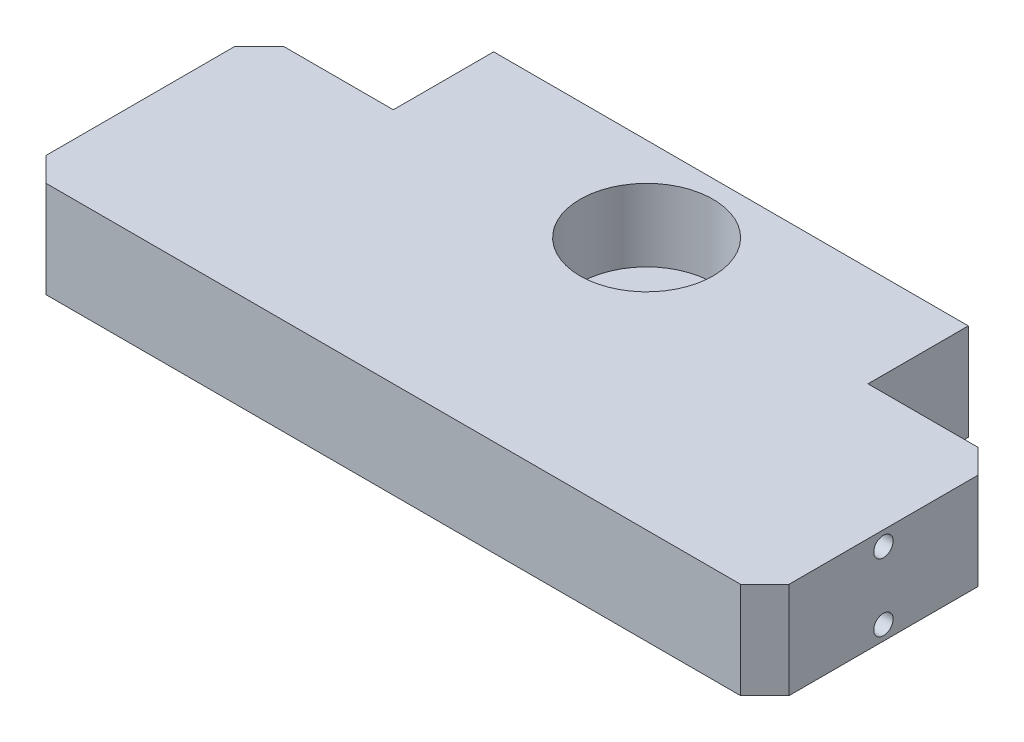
ISO-10303-21;
HEADER;
FILE_DESCRIPTION(('STEP AP214'),'2;1');
FILE_NAME('part.step','',(''),(''),'','','');
FILE_SCHEMA(('AUTOMOTIVE_DESIGN { 1 0 10303 214 1 1 1 1 }'));
ENDSEC;
DATA;
#1=APPLICATION_CONTEXT('core data for automotive mechanical design processes');
#2=APPLICATION_PROTOCOL_DEFINITION('international standard','automotive_design',2000,#1);
#3=PRODUCT_CONTEXT('',#1,'mechanical');
#4=PRODUCT('Part','Part','',(#3));
#5=PRODUCT_RELATED_PRODUCT_CATEGORY('part','',(#4));
#6=PRODUCT_DEFINITION_FORMATION('','',#4);
#7=PRODUCT_DEFINITION_CONTEXT('part definition',#1,'design');
#8=PRODUCT_DEFINITION('design','',#6,#7);
#9=PRODUCT_DEFINITION_SHAPE('','',#8);
#10=(LENGTH_UNIT() NAMED_UNIT(*) SI_UNIT(.MILLI.,.METRE.));
#11=(NAMED_UNIT(*) PLANE_ANGLE_UNIT() SI_UNIT($,.RADIAN.));
#12=(NAMED_UNIT(*) SI_UNIT($,.STERADIAN.) SOLID_ANGLE_UNIT());
#13=UNCERTAINTY_MEASURE_WITH_UNIT(LENGTH_MEASURE(1.E-05),#10,'distance_accuracy_value','');
#14=(GEOMETRIC_REPRESENTATION_CONTEXT(3) GLOBAL_UNCERTAINTY_ASSIGNED_CONTEXT((#13)) GLOBAL_UNIT_ASSIGNED_CONTEXT((#10,
#11,#12)) REPRESENTATION_CONTEXT('',''));
#15=CARTESIAN_POINT('',(0.,0.,0.));
#16=DIRECTION('',(0.,0.,1.));
#17=DIRECTION('',(1.,0.,0.));
#18=AXIS2_PLACEMENT_3D('',#15,#16,#17);
#19=CARTESIAN_POINT('',(0.,25.4,0.));
#20=DIRECTION('',(1.,0.,0.));
#21=DIRECTION('',(0.,0.,-1.));
#22=AXIS2_PLACEMENT_3D('',#19,#20,#21);
#23=PLANE('',#22);
#24=CARTESIAN_POINT('',(0.,21.59,-31.242));
#25=DIRECTION('',(-1.,0.,0.));
#26=DIRECTION('',(0.,0.,1.));
#27=AXIS2_PLACEMENT_3D('',#24,#25,#26);
#28=CIRCLE('',#27,2.55269999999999);
#29=CARTESIAN_POINT('',(0.,21.59,-28.6893));
#30=VERTEX_POINT('',#29);
#31=EDGE_CURVE('E148',#30,#30,#28,.T.);
#32=ORIENTED_EDGE('',*,*,#31,.F.);
#33=EDGE_LOOP('',(#32));
#34=FACE_BOUND('',#33,.T.);
#35=CARTESIAN_POINT('',(0.,3.81,-31.242));
#36=DIRECTION('',(-1.,0.,0.));
#37=DIRECTION('',(0.,0.,1.));
#38=AXIS2_PLACEMENT_3D('',#35,#36,#37);
#39=CIRCLE('',#38,2.55269999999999);
#40=CARTESIAN_POINT('',(0.,3.81,-28.6893));
#41=VERTEX_POINT('',#40);
#42=EDGE_CURVE('E156',#41,#41,#39,.T.);
#43=ORIENTED_EDGE('',*,*,#42,.F.);
#44=EDGE_LOOP('',(#43));
#45=FACE_BOUND('',#44,.T.);
#46=DIRECTION('',(0.,0.,1.));
#47=VECTOR('',#46,1.);
#48=CARTESIAN_POINT('',(0.,0.,0.));
#49=LINE('',#48,#47);
#50=CARTESIAN_POINT('',(0.,0.,-56.134));
#51=VERTEX_POINT('',#50);
#52=CARTESIAN_POINT('',(0.,0.,-6.35000000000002));
#53=VERTEX_POINT('',#52);
#54=EDGE_CURVE('E213',#51,#53,#49,.T.);
#55=ORIENTED_EDGE('',*,*,#54,.T.);
#56=DIRECTION('',(0.,1.,0.));
#57=VECTOR('',#56,1.);
#58=CARTESIAN_POINT('',(0.,25.4,-6.35000000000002));
#59=LINE('',#58,#57);
#60=CARTESIAN_POINT('',(0.,25.4,-6.35000000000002));
#61=VERTEX_POINT('',#60);
#62=EDGE_CURVE('E250',#53,#61,#59,.T.);
#63=ORIENTED_EDGE('',*,*,#62,.T.);
#64=DIRECTION('',(0.,0.,1.));
#65=VECTOR('',#64,1.);
#66=CARTESIAN_POINT('',(0.,25.4,0.));
#67=LINE('',#66,#65);
#68=CARTESIAN_POINT('',(0.,25.4,-56.134));
#69=VERTEX_POINT('',#68);
#70=EDGE_CURVE('E223',#69,#61,#67,.T.);
#71=ORIENTED_EDGE('',*,*,#70,.F.);
#72=DIRECTION('',(0.,-1.,0.));
#73=VECTOR('',#72,1.);
#74=CARTESIAN_POINT('',(0.,25.4,-56.134));
#75=LINE('',#74,#73);
#76=EDGE_CURVE('E247',#69,#51,#75,.T.);
#77=ORIENTED_EDGE('',*,*,#76,.T.);
#78=EDGE_LOOP('',(#55,#63,#71,#77));
#79=FACE_BOUND('',#78,.T.);
#80=ADVANCED_FACE('F38',(#34,#45,#79),#23,.F.);
#81=CARTESIAN_POINT('',(0.,25.4,0.));
#82=DIRECTION('',(0.,0.,-1.));
#83=DIRECTION('',(-1.,0.,0.));
#84=AXIS2_PLACEMENT_3D('',#81,#82,#83);
#85=PLANE('',#84);
#86=DIRECTION('',(1.,0.,0.));
#87=VECTOR('',#86,1.);
#88=CARTESIAN_POINT('',(0.,25.4,0.));
#89=LINE('',#88,#87);
#90=CARTESIAN_POINT('',(6.34999999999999,25.4,0.));
#91=VERTEX_POINT('',#90);
#92=CARTESIAN_POINT('',(189.23,25.4,0.));
#93=VERTEX_POINT('',#92);
#94=EDGE_CURVE('E226',#91,#93,#89,.T.);
#95=ORIENTED_EDGE('',*,*,#94,.F.);
#96=DIRECTION('',(0.,-1.,0.));
#97=VECTOR('',#96,1.);
#98=CARTESIAN_POINT('',(6.34999999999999,25.4,0.));
#99=LINE('',#98,#97);
#100=CARTESIAN_POINT('',(6.35,0.,0.));
#101=VERTEX_POINT('',#100);
#102=EDGE_CURVE('E236',#91,#101,#99,.T.);
#103=ORIENTED_EDGE('',*,*,#102,.T.);
#104=DIRECTION('',(1.,0.,0.));
#105=VECTOR('',#104,1.);
#106=CARTESIAN_POINT('',(0.,0.,0.));
#107=LINE('',#106,#105);
#108=CARTESIAN_POINT('',(189.23,0.,0.));
#109=VERTEX_POINT('',#108);
#110=EDGE_CURVE('E216',#101,#109,#107,.T.);
#111=ORIENTED_EDGE('',*,*,#110,.T.);
#112=DIRECTION('',(0.,1.,0.));
#113=VECTOR('',#112,1.);
#114=CARTESIAN_POINT('',(189.23,25.4,0.));
#115=LINE('',#114,#113);
#116=EDGE_CURVE('E232',#109,#93,#115,.T.);
#117=ORIENTED_EDGE('',*,*,#116,.T.);
#118=EDGE_LOOP('',(#95,#103,#111,#117));
#119=FACE_BOUND('',#118,.T.);
#120=ADVANCED_FACE('F310',(#119),#85,.F.);
#121=CARTESIAN_POINT('',(195.58,25.4,0.));
#122=DIRECTION('',(-1.,0.,0.));
#123=DIRECTION('',(0.,0.,1.));
#124=AXIS2_PLACEMENT_3D('',#121,#122,#123);
#125=PLANE('',#124);
#126=CARTESIAN_POINT('',(195.58,3.81,-31.242));
#127=DIRECTION('',(1.,0.,0.));
#128=DIRECTION('',(0.,0.,-1.));
#129=AXIS2_PLACEMENT_3D('',#126,#127,#128);
#130=CIRCLE('',#129,2.5527);
#131=CARTESIAN_POINT('',(195.58,3.81,-33.7947));
#132=VERTEX_POINT('',#131);
#133=EDGE_CURVE('E162',#132,#132,#130,.T.);
#134=ORIENTED_EDGE('',*,*,#133,.F.);
#135=EDGE_LOOP('',(#134));
#136=FACE_BOUND('',#135,.T.);
#137=CARTESIAN_POINT('',(195.58,21.59,-31.242));
#138=DIRECTION('',(1.,0.,0.));
#139=DIRECTION('',(0.,0.,-1.));
#140=AXIS2_PLACEMENT_3D('',#137,#138,#139);
#141=CIRCLE('',#140,2.5527);
#142=CARTESIAN_POINT('',(195.58,21.59,-33.7947));
#143=VERTEX_POINT('',#142);
#144=EDGE_CURVE('E168',#143,#143,#141,.T.);
#145=ORIENTED_EDGE('',*,*,#144,.F.);
#146=EDGE_LOOP('',(#145));
#147=FACE_BOUND('',#146,.T.);
#148=DIRECTION('',(0.,0.,-1.));
#149=VECTOR('',#148,1.);
#150=CARTESIAN_POINT('',(195.58,25.4,0.));
#151=LINE('',#150,#149);
#152=CARTESIAN_POINT('',(195.58,25.4,-6.34999999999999));
#153=VERTEX_POINT('',#152);
#154=CARTESIAN_POINT('',(195.58,25.4,-56.1339999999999));
#155=VERTEX_POINT('',#154);
#156=EDGE_CURVE('E228',#153,#155,#151,.T.);
#157=ORIENTED_EDGE('',*,*,#156,.F.);
#158=DIRECTION('',(0.,-1.,0.));
#159=VECTOR('',#158,1.);
#160=CARTESIAN_POINT('',(195.58,25.4,-6.34999999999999));
#161=LINE('',#160,#159);
#162=CARTESIAN_POINT('',(195.58,0.,-6.34999999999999));
#163=VERTEX_POINT('',#162);
#164=EDGE_CURVE('E45',#153,#163,#161,.T.);
#165=ORIENTED_EDGE('',*,*,#164,.T.);
#166=DIRECTION('',(0.,0.,-1.));
#167=VECTOR('',#166,1.);
#168=CARTESIAN_POINT('',(195.58,0.,0.));
#169=LINE('',#168,#167);
#170=CARTESIAN_POINT('',(195.58,0.,-56.1339999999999));
#171=VERTEX_POINT('',#170);
#172=EDGE_CURVE('E219',#163,#171,#169,.T.);
#173=ORIENTED_EDGE('',*,*,#172,.T.);
#174=DIRECTION('',(0.,1.,0.));
#175=VECTOR('',#174,1.);
#176=CARTESIAN_POINT('',(195.58,25.4,-56.1339999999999));
#177=LINE('',#176,#175);
#178=EDGE_CURVE('E52',#171,#155,#177,.T.);
#179=ORIENTED_EDGE('',*,*,#178,.T.);
#180=EDGE_LOOP('',(#157,#165,#173,#179));
#181=FACE_BOUND('',#180,.T.);
#182=ADVANCED_FACE('F264',(#136,#147,#181),#125,.F.);
#183=CARTESIAN_POINT('',(0.,25.4,-88.9));
#184=DIRECTION('',(0.,0.,1.));
#185=DIRECTION('',(1.,0.,0.));
#186=AXIS2_PLACEMENT_3D('',#183,#184,#185);
#187=PLANE('',#186);
#188=DIRECTION('',(-1.,0.,0.));
#189=VECTOR('',#188,1.);
#190=CARTESIAN_POINT('',(0.,25.4,-88.9));
#191=LINE('',#190,#189);
#192=CARTESIAN_POINT('',(160.274,25.4,-88.9));
#193=VERTEX_POINT('',#192);
#194=CARTESIAN_POINT('',(35.306,25.4,-88.9));
#195=VERTEX_POINT('',#194);
#196=EDGE_CURVE('E230',#193,#195,#191,.T.);
#197=ORIENTED_EDGE('',*,*,#196,.F.);
#198=DIRECTION('',(0.,-1.,0.));
#199=VECTOR('',#198,1.);
#200=CARTESIAN_POINT('',(160.274,25.4,-88.9));
#201=LINE('',#200,#199);
#202=CARTESIAN_POINT('',(160.274,0.,-88.9));
#203=VERTEX_POINT('',#202);
#204=EDGE_CURVE('E181',#193,#203,#201,.T.);
#205=ORIENTED_EDGE('',*,*,#204,.T.);
#206=DIRECTION('',(-1.,0.,0.));
#207=VECTOR('',#206,1.);
#208=CARTESIAN_POINT('',(0.,0.,-88.9));
#209=LINE('',#208,#207);
#210=CARTESIAN_POINT('',(35.306,0.,-88.9));
#211=VERTEX_POINT('',#210);
#212=EDGE_CURVE('E221',#203,#211,#209,.T.);
#213=ORIENTED_EDGE('',*,*,#212,.T.);
#214=DIRECTION('',(0.,-1.,0.));
#215=VECTOR('',#214,1.);
#216=CARTESIAN_POINT('',(35.306,25.4,-88.9));
#217=LINE('',#216,#215);
#218=EDGE_CURVE('E198',#195,#211,#217,.T.);
#219=ORIENTED_EDGE('',*,*,#218,.F.);
#220=EDGE_LOOP('',(#197,#205,#213,#219));
#221=FACE_BOUND('',#220,.T.);
#222=ADVANCED_FACE('F287',(#221),#187,.F.);
#223=CARTESIAN_POINT('',(0.,25.4,-88.9));
#224=DIRECTION('',(0.,-1.,0.));
#225=DIRECTION('',(0.,0.,-1.));
#226=AXIS2_PLACEMENT_3D('',#223,#224,#225);
#227=PLANE('',#226);
#228=CARTESIAN_POINT('',(97.79,25.4,-66.675));
#229=DIRECTION('',(0.,1.,0.));
#230=DIRECTION('',(0.,0.,1.));
#231=AXIS2_PLACEMENT_3D('',#228,#229,#230);
#232=CIRCLE('',#231,17.5006);
#233=CARTESIAN_POINT('',(97.79,25.4,-49.1744));
#234=VERTEX_POINT('',#233);
#235=EDGE_CURVE('E207',#234,#234,#232,.T.);
#236=ORIENTED_EDGE('',*,*,#235,.F.);
#237=EDGE_LOOP('',(#236));
#238=FACE_BOUND('',#237,.T.);
#239=ORIENTED_EDGE('',*,*,#70,.T.);
#240=DIRECTION('',(-0.707106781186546,0.,-0.707106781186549));
#241=VECTOR('',#240,1.);
#242=CARTESIAN_POINT('',(6.34999999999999,25.4,0.));
#243=LINE('',#242,#241);
#244=EDGE_CURVE('E257',#61,#91,#243,.F.);
#245=ORIENTED_EDGE('',*,*,#244,.T.);
#246=ORIENTED_EDGE('',*,*,#94,.T.);
#247=DIRECTION('',(-0.707106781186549,0.,0.707106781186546));
#248=VECTOR('',#247,1.);
#249=CARTESIAN_POINT('',(195.58,25.4,-6.34999999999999));
#250=LINE('',#249,#248);
#251=EDGE_CURVE('E59',#93,#153,#250,.F.);
#252=ORIENTED_EDGE('',*,*,#251,.T.);
#253=ORIENTED_EDGE('',*,*,#156,.T.);
#254=DIRECTION('',(0.707106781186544,0.,0.707106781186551));
#255=VECTOR('',#254,1.);
#256=CARTESIAN_POINT('',(189.23,25.4,-62.484));
#257=LINE('',#256,#255);
#258=CARTESIAN_POINT('',(189.23,25.4,-62.484));
#259=VERTEX_POINT('',#258);
#260=EDGE_CURVE('E252',#155,#259,#257,.F.);
#261=ORIENTED_EDGE('',*,*,#260,.T.);
#262=DIRECTION('',(-1.,0.,0.));
#263=VECTOR('',#262,1.);
#264=CARTESIAN_POINT('',(195.58,25.4,-62.484));
#265=LINE('',#264,#263);
#266=CARTESIAN_POINT('',(160.274,25.4,-62.484));
#267=VERTEX_POINT('',#266);
#268=EDGE_CURVE('E175',#259,#267,#265,.T.);
#269=ORIENTED_EDGE('',*,*,#268,.T.);
#270=DIRECTION('',(0.,0.,-1.));
#271=VECTOR('',#270,1.);
#272=CARTESIAN_POINT('',(160.274,25.4,-88.9));
#273=LINE('',#272,#271);
#274=EDGE_CURVE('E177',#267,#193,#273,.T.);
#275=ORIENTED_EDGE('',*,*,#274,.T.);
#276=ORIENTED_EDGE('',*,*,#196,.T.);
#277=DIRECTION('',(0.,0.,1.));
#278=VECTOR('',#277,1.);
#279=CARTESIAN_POINT('',(35.306,25.4,-88.9));
#280=LINE('',#279,#278);
#281=CARTESIAN_POINT('',(35.306,25.4,-62.484));
#282=VERTEX_POINT('',#281);
#283=EDGE_CURVE('E192',#195,#282,#280,.T.);
#284=ORIENTED_EDGE('',*,*,#283,.T.);
#285=DIRECTION('',(-1.,0.,0.));
#286=VECTOR('',#285,1.);
#287=CARTESIAN_POINT('',(0.,25.4,-62.484));
#288=LINE('',#287,#286);
#289=CARTESIAN_POINT('',(6.34999999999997,25.4,-62.484));
#290=VERTEX_POINT('',#289);
#291=EDGE_CURVE('E195',#282,#290,#288,.T.);
#292=ORIENTED_EDGE('',*,*,#291,.T.);
#293=DIRECTION('',(0.707106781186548,0.,-0.707106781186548));
#294=VECTOR('',#293,1.);
#295=CARTESIAN_POINT('',(0.,25.4,-56.134));
#296=LINE('',#295,#294);
#297=EDGE_CURVE('E255',#290,#69,#296,.F.);
#298=ORIENTED_EDGE('',*,*,#297,.T.);
#299=EDGE_LOOP('',(#239,#245,#246,#252,#253,#261,#269,#275,#276,#284,#292,#298));
#300=FACE_BOUND('',#299,.T.);
#301=ADVANCED_FACE('F281',(#238,#300),#227,.F.);
#302=CARTESIAN_POINT('',(0.,0.,-88.9));
#303=DIRECTION('',(0.,-1.,0.));
#304=DIRECTION('',(0.,0.,-1.));
#305=AXIS2_PLACEMENT_3D('',#302,#303,#304);
#306=PLANE('',#305);
#307=ORIENTED_EDGE('',*,*,#110,.F.);
#308=DIRECTION('',(0.707106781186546,0.,0.707106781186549));
#309=VECTOR('',#308,1.);
#310=CARTESIAN_POINT('',(-41.275,0.,-47.6250000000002));
#311=LINE('',#310,#309);
#312=EDGE_CURVE('E245',#101,#53,#311,.F.);
#313=ORIENTED_EDGE('',*,*,#312,.T.);
#314=ORIENTED_EDGE('',*,*,#54,.F.);
#315=DIRECTION('',(-0.707106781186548,0.,0.707106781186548));
#316=VECTOR('',#315,1.);
#317=CARTESIAN_POINT('',(16.383,0.,-72.517));
#318=LINE('',#317,#316);
#319=CARTESIAN_POINT('',(6.34999999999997,0.,-62.484));
#320=VERTEX_POINT('',#319);
#321=EDGE_CURVE('E243',#51,#320,#318,.F.);
#322=ORIENTED_EDGE('',*,*,#321,.T.);
#323=DIRECTION('',(-1.,0.,0.));
#324=VECTOR('',#323,1.);
#325=CARTESIAN_POINT('',(0.,0.,-62.484));
#326=LINE('',#325,#324);
#327=CARTESIAN_POINT('',(35.306,0.,-62.484));
#328=VERTEX_POINT('',#327);
#329=EDGE_CURVE('E189',#328,#320,#326,.T.);
#330=ORIENTED_EDGE('',*,*,#329,.F.);
#331=DIRECTION('',(0.,0.,1.));
#332=VECTOR('',#331,1.);
#333=CARTESIAN_POINT('',(35.306,0.,-88.9));
#334=LINE('',#333,#332);
#335=EDGE_CURVE('E184',#211,#328,#334,.T.);
#336=ORIENTED_EDGE('',*,*,#335,.F.);
#337=ORIENTED_EDGE('',*,*,#212,.F.);
#338=DIRECTION('',(0.,0.,-1.));
#339=VECTOR('',#338,1.);
#340=CARTESIAN_POINT('',(160.274,0.,-88.9));
#341=LINE('',#340,#339);
#342=CARTESIAN_POINT('',(160.274,0.,-62.484));
#343=VERTEX_POINT('',#342);
#344=EDGE_CURVE('E173',#343,#203,#341,.T.);
#345=ORIENTED_EDGE('',*,*,#344,.F.);
#346=DIRECTION('',(-1.,0.,0.));
#347=VECTOR('',#346,1.);
#348=CARTESIAN_POINT('',(195.58,0.,-62.484));
#349=LINE('',#348,#347);
#350=CARTESIAN_POINT('',(189.23,0.,-62.484));
#351=VERTEX_POINT('',#350);
#352=EDGE_CURVE('E171',#351,#343,#349,.T.);
#353=ORIENTED_EDGE('',*,*,#352,.F.);
#354=DIRECTION('',(-0.707106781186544,0.,-0.707106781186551));
#355=VECTOR('',#354,1.);
#356=CARTESIAN_POINT('',(81.4070000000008,0.,-170.307));
#357=LINE('',#356,#355);
#358=EDGE_CURVE('E239',#351,#171,#357,.F.);
#359=ORIENTED_EDGE('',*,*,#358,.T.);
#360=ORIENTED_EDGE('',*,*,#172,.F.);
#361=DIRECTION('',(0.707106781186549,0.,-0.707106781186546));
#362=VECTOR('',#361,1.);
#363=CARTESIAN_POINT('',(139.065,0.,50.1650000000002));
#364=LINE('',#363,#362);
#365=EDGE_CURVE('E241',#163,#109,#364,.F.);
#366=ORIENTED_EDGE('',*,*,#365,.T.);
#367=EDGE_LOOP('',(#307,#313,#314,#322,#330,#336,#337,#345,#353,#359,#360,#366));
#368=FACE_BOUND('',#367,.T.);
#369=CARTESIAN_POINT('',(97.79,0.,-66.675));
#370=DIRECTION('',(0.,-1.,0.));
#371=DIRECTION('',(0.,0.,-1.));
#372=AXIS2_PLACEMENT_3D('',#369,#370,#371);
#373=CIRCLE('',#372,4.95300000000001);
#374=CARTESIAN_POINT('',(97.79,0.,-71.628));
#375=VERTEX_POINT('',#374);
#376=EDGE_CURVE('E201',#375,#375,#373,.T.);
#377=ORIENTED_EDGE('',*,*,#376,.F.);
#378=EDGE_LOOP('',(#377));
#379=FACE_BOUND('',#378,.T.);
#380=ADVANCED_FACE('F268',(#368,#379),#306,.T.);
#381=CARTESIAN_POINT('',(97.79,6.35,-66.675));
#382=DIRECTION('',(0.,1.,0.));
#383=DIRECTION('',(0.,0.,1.));
#384=AXIS2_PLACEMENT_3D('',#381,#382,#383);
#385=CYLINDRICAL_SURFACE('',#384,17.5006);
#386=CARTESIAN_POINT('',(97.79,6.35,-66.675));
#387=DIRECTION('',(0.,1.,0.));
#388=DIRECTION('',(0.,0.,1.));
#389=AXIS2_PLACEMENT_3D('',#386,#387,#388);
#390=CIRCLE('',#389,17.5006);
#391=CARTESIAN_POINT('',(97.79,6.35,-49.1744));
#392=VERTEX_POINT('',#391);
#393=EDGE_CURVE('E210',#392,#392,#390,.T.);
#394=CARTESIAN_POINT('',(97.79,6.35,-49.1744));
#395=CARTESIAN_POINT('',(97.79,6.5484375,-49.1744));
#396=CARTESIAN_POINT('',(97.79,6.746875,-49.1744));
#397=CARTESIAN_POINT('',(97.79,7.14375,-49.1744));
#398=CARTESIAN_POINT('',(97.79,7.3421875,-49.1744));
#399=CARTESIAN_POINT('',(97.79,7.7390625,-49.1744));
#400=CARTESIAN_POINT('',(97.79,7.9375,-49.1744));
#401=CARTESIAN_POINT('',(97.79,8.334375,-49.1744));
#402=CARTESIAN_POINT('',(97.79,8.5328125,-49.1744));
#403=CARTESIAN_POINT('',(97.79,8.9296875,-49.1744));
#404=CARTESIAN_POINT('',(97.79,9.128125,-49.1744));
#405=CARTESIAN_POINT('',(97.79,9.525,-49.1744));
#406=CARTESIAN_POINT('',(97.79,9.7234375,-49.1744));
#407=CARTESIAN_POINT('',(97.79,10.1203125,-49.1744));
#408=CARTESIAN_POINT('',(97.79,10.31875,-49.1744));
#409=CARTESIAN_POINT('',(97.79,10.715625,-49.1744));
#410=CARTESIAN_POINT('',(97.79,10.9140625,-49.1744));
#411=CARTESIAN_POINT('',(97.79,11.3109375,-49.1744));
#412=CARTESIAN_POINT('',(97.79,11.509375,-49.1744));
#413=CARTESIAN_POINT('',(97.79,11.90625,-49.1744));
#414=CARTESIAN_POINT('',(97.79,12.1046875,-49.1744));
#415=CARTESIAN_POINT('',(97.79,12.5015625,-49.1744));
#416=CARTESIAN_POINT('',(97.79,12.7,-49.1744));
#417=CARTESIAN_POINT('',(97.79,13.096875,-49.1744));
#418=CARTESIAN_POINT('',(97.79,13.2953125,-49.1744));
#419=CARTESIAN_POINT('',(97.79,13.6921875,-49.1744));
#420=CARTESIAN_POINT('',(97.79,13.890625,-49.1744));
#421=CARTESIAN_POINT('',(97.79,14.2875,-49.1744));
#422=CARTESIAN_POINT('',(97.79,14.4859375,-49.1744));
#423=CARTESIAN_POINT('',(97.79,14.8828125,-49.1744));
#424=CARTESIAN_POINT('',(97.79,15.08125,-49.1744));
#425=CARTESIAN_POINT('',(97.79,15.478125,-49.1744));
#426=CARTESIAN_POINT('',(97.79,15.6765625,-49.1744));
#427=CARTESIAN_POINT('',(97.79,16.0734375,-49.1744));
#428=CARTESIAN_POINT('',(97.79,16.271875,-49.1744));
#429=CARTESIAN_POINT('',(97.79,16.66875,-49.1744));
#430=CARTESIAN_POINT('',(97.79,16.8671875,-49.1744));
#431=CARTESIAN_POINT('',(97.79,17.2640625,-49.1744));
#432=CARTESIAN_POINT('',(97.79,17.4625,-49.1744));
#433=CARTESIAN_POINT('',(97.79,17.859375,-49.1744));
#434=CARTESIAN_POINT('',(97.79,18.0578125,-49.1744));
#435=CARTESIAN_POINT('',(97.79,18.4546875,-49.1744));
#436=CARTESIAN_POINT('',(97.79,18.653125,-49.1744));
#437=CARTESIAN_POINT('',(97.79,19.05,-49.1744));
#438=CARTESIAN_POINT('',(97.79,19.2484375,-49.1744));
#439=CARTESIAN_POINT('',(97.79,19.6453125,-49.1744));
#440=CARTESIAN_POINT('',(97.79,19.84375,-49.1744));
#441=CARTESIAN_POINT('',(97.79,20.240625,-49.1744));
#442=CARTESIAN_POINT('',(97.79,20.4390625,-49.1744));
#443=CARTESIAN_POINT('',(97.79,20.8359375,-49.1744));
#444=CARTESIAN_POINT('',(97.79,21.034375,-49.1744));
#445=CARTESIAN_POINT('',(97.79,21.43125,-49.1744));
#446=CARTESIAN_POINT('',(97.79,21.6296875,-49.1744));
#447=CARTESIAN_POINT('',(97.79,22.0265625,-49.1744));
#448=CARTESIAN_POINT('',(97.79,22.225,-49.1744));
#449=CARTESIAN_POINT('',(97.79,22.621875,-49.1744));
#450=CARTESIAN_POINT('',(97.79,22.8203125,-49.1744));
#451=CARTESIAN_POINT('',(97.79,23.2171875,-49.1744));
#452=CARTESIAN_POINT('',(97.79,23.415625,-49.1744));
#453=CARTESIAN_POINT('',(97.79,23.8125,-49.1744));
#454=CARTESIAN_POINT('',(97.79,24.0109375,-49.1744));
#455=CARTESIAN_POINT('',(97.79,24.4078125,-49.1744));
#456=CARTESIAN_POINT('',(97.79,24.60625,-49.1744));
#457=CARTESIAN_POINT('',(97.79,25.003125,-49.1744));
#458=CARTESIAN_POINT('',(97.79,25.2015625,-49.1744));
#459=CARTESIAN_POINT('',(97.79,25.4,-49.1744));
#460=B_SPLINE_CURVE_WITH_KNOTS('',3,(#394,#395,#396,#397,#398,#399,#400,#401,#402,#403,#404,
#405,#406,#407,#408,#409,#410,#411,#412,#413,#414,#415,#416,#417,#418,#419,#420,#421,#422,#423,
#424,#425,#426,#427,#428,#429,#430,#431,#432,#433,#434,#435,#436,#437,#438,#439,#440,#441,#442,
#443,#444,#445,#446,#447,#448,#449,#450,#451,#452,#453,#454,#455,#456,#457,#458,#459),
.UNSPECIFIED.,.F.,.F.,(4,2,2,2,2,2,2,2,2,2,2,2,2,2,2,2,2,2,2,2,2,2,2,2,2,2,2,2,2,2,2,2,4),(0.,
0.5953125,1.190625,1.7859375,2.38125,2.9765625,3.571875,4.1671875,4.7625,5.3578125,5.953125,
6.5484375,7.14375,7.7390625,8.334375,8.9296875,9.525,10.1203125,10.715625,11.3109375,11.90625,
12.5015625,13.096875,13.6921875,14.2875,14.8828125,15.478125,16.0734375,16.66875,17.2640625,
17.859375,18.4546875,19.05),.UNSPECIFIED.);
#461=EDGE_CURVE('BSEAM375',#392,#234,#460,.T.);
#462=ORIENTED_EDGE('',*,*,#393,.F.);
#463=ORIENTED_EDGE('',*,*,#235,.T.);
#464=ORIENTED_EDGE('',*,*,#461,.T.);
#465=ORIENTED_EDGE('',*,*,#461,.F.);
#466=EDGE_LOOP('',(#462,#464,#463,#465));
#467=FACE_BOUND('',#466,.T.);
#468=ADVANCED_FACE('F375',(#467),#385,.F.);
#469=CARTESIAN_POINT('',(97.79,6.35,-66.675));
#470=DIRECTION('',(0.,1.,0.));
#471=DIRECTION('',(0.,0.,1.));
#472=AXIS2_PLACEMENT_3D('',#469,#470,#471);
#473=PLANE('',#472);
#474=CARTESIAN_POINT('',(97.79,6.35,-66.675));
#475=DIRECTION('',(0.,1.,0.));
#476=DIRECTION('',(0.,0.,1.));
#477=AXIS2_PLACEMENT_3D('',#474,#475,#476);
#478=CIRCLE('',#477,4.95300000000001);
#479=CARTESIAN_POINT('',(97.79,6.35,-61.722));
#480=VERTEX_POINT('',#479);
#481=EDGE_CURVE('E206',#480,#480,#478,.T.);
#482=ORIENTED_EDGE('',*,*,#481,.F.);
#483=EDGE_LOOP('',(#482));
#484=FACE_BOUND('',#483,.T.);
#485=ORIENTED_EDGE('',*,*,#393,.T.);
#486=EDGE_LOOP('',(#485));
#487=FACE_BOUND('',#486,.T.);
#488=ADVANCED_FACE('F371',(#484,#487),#473,.T.);
#489=CARTESIAN_POINT('',(97.79,25.4,-66.675));
#490=DIRECTION('',(0.,-1.,0.));
#491=DIRECTION('',(0.,0.,-1.));
#492=AXIS2_PLACEMENT_3D('',#489,#490,#491);
#493=CYLINDRICAL_SURFACE('',#492,4.95300000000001);
#494=ORIENTED_EDGE('',*,*,#481,.T.);
#495=EDGE_LOOP('',(#494));
#496=FACE_BOUND('',#495,.T.);
#497=ORIENTED_EDGE('',*,*,#376,.T.);
#498=EDGE_LOOP('',(#497));
#499=FACE_BOUND('',#498,.T.);
#500=ADVANCED_FACE('F366',(#496,#499),#493,.F.);
#501=CARTESIAN_POINT('',(0.,25.4,-62.484));
#502=DIRECTION('',(0.,0.,1.));
#503=DIRECTION('',(1.,0.,0.));
#504=AXIS2_PLACEMENT_3D('',#501,#502,#503);
#505=PLANE('',#504);
#506=ORIENTED_EDGE('',*,*,#329,.T.);
#507=DIRECTION('',(0.,1.,0.));
#508=VECTOR('',#507,1.);
#509=CARTESIAN_POINT('',(6.34999999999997,25.4,-62.484));
#510=LINE('',#509,#508);
#511=EDGE_CURVE('E259',#320,#290,#510,.T.);
#512=ORIENTED_EDGE('',*,*,#511,.T.);
#513=ORIENTED_EDGE('',*,*,#291,.F.);
#514=DIRECTION('',(0.,-1.,0.));
#515=VECTOR('',#514,1.);
#516=CARTESIAN_POINT('',(35.306,25.4,-62.484));
#517=LINE('',#516,#515);
#518=EDGE_CURVE('E199',#282,#328,#517,.T.);
#519=ORIENTED_EDGE('',*,*,#518,.T.);
#520=EDGE_LOOP('',(#506,#512,#513,#519));
#521=FACE_BOUND('',#520,.T.);
#522=ADVANCED_FACE('F296',(#521),#505,.F.);
#523=CARTESIAN_POINT('',(35.306,25.4,-88.9));
#524=DIRECTION('',(1.,0.,0.));
#525=DIRECTION('',(0.,0.,-1.));
#526=AXIS2_PLACEMENT_3D('',#523,#524,#525);
#527=PLANE('',#526);
#528=ORIENTED_EDGE('',*,*,#335,.T.);
#529=ORIENTED_EDGE('',*,*,#518,.F.);
#530=ORIENTED_EDGE('',*,*,#283,.F.);
#531=ORIENTED_EDGE('',*,*,#218,.T.);
#532=EDGE_LOOP('',(#528,#529,#530,#531));
#533=FACE_BOUND('',#532,.T.);
#534=ADVANCED_FACE('F291',(#533),#527,.F.);
#535=CARTESIAN_POINT('',(160.274,25.4,-88.9));
#536=DIRECTION('',(-1.,0.,0.));
#537=DIRECTION('',(0.,0.,1.));
#538=AXIS2_PLACEMENT_3D('',#535,#536,#537);
#539=PLANE('',#538);
#540=ORIENTED_EDGE('',*,*,#344,.T.);
#541=ORIENTED_EDGE('',*,*,#204,.F.);
#542=ORIENTED_EDGE('',*,*,#274,.F.);
#543=DIRECTION('',(0.,-1.,0.));
#544=VECTOR('',#543,1.);
#545=CARTESIAN_POINT('',(160.274,25.4,-62.484));
#546=LINE('',#545,#544);
#547=EDGE_CURVE('E180',#267,#343,#546,.T.);
#548=ORIENTED_EDGE('',*,*,#547,.T.);
#549=EDGE_LOOP('',(#540,#541,#542,#548));
#550=FACE_BOUND('',#549,.T.);
#551=ADVANCED_FACE('F359',(#550),#539,.F.);
#552=CARTESIAN_POINT('',(195.58,25.4,-62.484));
#553=DIRECTION('',(0.,0.,1.));
#554=DIRECTION('',(1.,0.,0.));
#555=AXIS2_PLACEMENT_3D('',#552,#553,#554);
#556=PLANE('',#555);
#557=ORIENTED_EDGE('',*,*,#268,.F.);
#558=DIRECTION('',(0.,-1.,0.));
#559=VECTOR('',#558,1.);
#560=CARTESIAN_POINT('',(189.23,25.4,-62.484));
#561=LINE('',#560,#559);
#562=EDGE_CURVE('E11',#259,#351,#561,.T.);
#563=ORIENTED_EDGE('',*,*,#562,.T.);
#564=ORIENTED_EDGE('',*,*,#352,.T.);
#565=ORIENTED_EDGE('',*,*,#547,.F.);
#566=EDGE_LOOP('',(#557,#563,#564,#565));
#567=FACE_BOUND('',#566,.T.);
#568=ADVANCED_FACE('F278',(#567),#556,.F.);
#569=CARTESIAN_POINT('',(195.58,21.59,-31.242));
#570=DIRECTION('',(1.,0.,0.));
#571=DIRECTION('',(0.,0.,-1.));
#572=AXIS2_PLACEMENT_3D('',#569,#570,#571);
#573=CYLINDRICAL_SURFACE('',#572,2.5527);
#574=CARTESIAN_POINT('',(176.53,21.59,-31.242));
#575=DIRECTION('',(1.,0.,0.));
#576=DIRECTION('',(0.,0.,-1.));
#577=AXIS2_PLACEMENT_3D('',#574,#575,#576);
#578=CIRCLE('',#577,2.5527);
#579=CARTESIAN_POINT('',(176.53,21.59,-33.7947));
#580=VERTEX_POINT('',#579);
#581=EDGE_CURVE('E165',#580,#580,#578,.T.);
#582=ORIENTED_EDGE('',*,*,#581,.F.);
#583=EDGE_LOOP('',(#582));
#584=FACE_BOUND('',#583,.T.);
#585=ORIENTED_EDGE('',*,*,#144,.T.);
#586=EDGE_LOOP('',(#585));
#587=FACE_BOUND('',#586,.T.);
#588=ADVANCED_FACE('F354',(#584,#587),#573,.F.);
#589=CARTESIAN_POINT('',(176.53,21.59,-31.242));
#590=DIRECTION('',(1.,0.,0.));
#591=DIRECTION('',(0.,0.,-1.));
#592=AXIS2_PLACEMENT_3D('',#589,#590,#591);
#593=CONICAL_SURFACE('',#592,2.5527,1.02974425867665);
#594=CARTESIAN_POINT('',(174.996183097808,21.59,-31.242));
#595=VERTEX_POINT('',#594);
#596=VERTEX_LOOP('',#595);
#597=FACE_BOUND('',#596,.T.);
#598=ORIENTED_EDGE('',*,*,#581,.T.);
#599=EDGE_LOOP('',(#598));
#600=FACE_BOUND('',#599,.T.);
#601=ADVANCED_FACE('F350',(#597,#600),#593,.F.);
#602=CARTESIAN_POINT('',(195.58,3.81,-31.242));
#603=DIRECTION('',(1.,0.,0.));
#604=DIRECTION('',(0.,0.,-1.));
#605=AXIS2_PLACEMENT_3D('',#602,#603,#604);
#606=CYLINDRICAL_SURFACE('',#605,2.5527);
#607=CARTESIAN_POINT('',(176.53,3.81,-31.242));
#608=DIRECTION('',(1.,0.,0.));
#609=DIRECTION('',(0.,0.,-1.));
#610=AXIS2_PLACEMENT_3D('',#607,#608,#609);
#611=CIRCLE('',#610,2.5527);
#612=CARTESIAN_POINT('',(176.53,3.81,-33.7947));
#613=VERTEX_POINT('',#612);
#614=EDGE_CURVE('E159',#613,#613,#611,.T.);
#615=ORIENTED_EDGE('',*,*,#614,.F.);
#616=EDGE_LOOP('',(#615));
#617=FACE_BOUND('',#616,.T.);
#618=ORIENTED_EDGE('',*,*,#133,.T.);
#619=EDGE_LOOP('',(#618));
#620=FACE_BOUND('',#619,.T.);
#621=ADVANCED_FACE('F342',(#617,#620),#606,.F.);
#622=CARTESIAN_POINT('',(176.53,3.81,-31.242));
#623=DIRECTION('',(1.,0.,0.));
#624=DIRECTION('',(0.,0.,-1.));
#625=AXIS2_PLACEMENT_3D('',#622,#623,#624);
#626=CONICAL_SURFACE('',#625,2.5527,1.02974425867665);
#627=CARTESIAN_POINT('',(174.996183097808,3.80999999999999,-31.242));
#628=VERTEX_POINT('',#627);
#629=VERTEX_LOOP('',#628);
#630=FACE_BOUND('',#629,.T.);
#631=ORIENTED_EDGE('',*,*,#614,.T.);
#632=EDGE_LOOP('',(#631));
#633=FACE_BOUND('',#632,.T.);
#634=ADVANCED_FACE('F333',(#630,#633),#626,.F.);
#635=CARTESIAN_POINT('',(0.,3.81,-31.242));
#636=DIRECTION('',(-1.,0.,0.));
#637=DIRECTION('',(0.,0.,1.));
#638=AXIS2_PLACEMENT_3D('',#635,#636,#637);
#639=CYLINDRICAL_SURFACE('',#638,2.55269999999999);
#640=CARTESIAN_POINT('',(19.05,3.81,-31.242));
#641=DIRECTION('',(-1.,0.,0.));
#642=DIRECTION('',(0.,0.,1.));
#643=AXIS2_PLACEMENT_3D('',#640,#641,#642);
#644=CIRCLE('',#643,2.55269999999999);
#645=CARTESIAN_POINT('',(19.05,3.81,-28.6893));
#646=VERTEX_POINT('',#645);
#647=EDGE_CURVE('E151',#646,#646,#644,.T.);
#648=ORIENTED_EDGE('',*,*,#647,.F.);
#649=EDGE_LOOP('',(#648));
#650=FACE_BOUND('',#649,.T.);
#651=ORIENTED_EDGE('',*,*,#42,.T.);
#652=EDGE_LOOP('',(#651));
#653=FACE_BOUND('',#652,.T.);
#654=ADVANCED_FACE('F330',(#650,#653),#639,.F.);
#655=CARTESIAN_POINT('',(19.05,3.81,-31.242));
#656=DIRECTION('',(-1.,0.,0.));
#657=DIRECTION('',(0.,0.,1.));
#658=AXIS2_PLACEMENT_3D('',#655,#656,#657);
#659=CONICAL_SURFACE('',#658,2.55269999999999,1.02974425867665);
#660=CARTESIAN_POINT('',(20.5838169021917,3.81,-31.242));
#661=VERTEX_POINT('',#660);
#662=VERTEX_LOOP('',#661);
#663=FACE_BOUND('',#662,.T.);
#664=ORIENTED_EDGE('',*,*,#647,.T.);
#665=EDGE_LOOP('',(#664));
#666=FACE_BOUND('',#665,.T.);
#667=ADVANCED_FACE('F332',(#663,#666),#659,.F.);
#668=CARTESIAN_POINT('',(0.,21.59,-31.242));
#669=DIRECTION('',(-1.,0.,0.));
#670=DIRECTION('',(0.,0.,1.));
#671=AXIS2_PLACEMENT_3D('',#668,#669,#670);
#672=CYLINDRICAL_SURFACE('',#671,2.55269999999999);
#673=CARTESIAN_POINT('',(19.05,21.59,-31.242));
#674=DIRECTION('',(-1.,0.,0.));
#675=DIRECTION('',(0.,0.,1.));
#676=AXIS2_PLACEMENT_3D('',#673,#674,#675);
#677=CIRCLE('',#676,2.55269999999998);
#678=CARTESIAN_POINT('',(19.05,21.59,-28.6893));
#679=VERTEX_POINT('',#678);
#680=EDGE_CURVE('E146',#679,#679,#677,.T.);
#681=ORIENTED_EDGE('',*,*,#680,.F.);
#682=EDGE_LOOP('',(#681));
#683=FACE_BOUND('',#682,.T.);
#684=ORIENTED_EDGE('',*,*,#31,.T.);
#685=EDGE_LOOP('',(#684));
#686=FACE_BOUND('',#685,.T.);
#687=ADVANCED_FACE('F142',(#683,#686),#672,.F.);
#688=CARTESIAN_POINT('',(19.05,21.59,-31.242));
#689=DIRECTION('',(-1.,0.,0.));
#690=DIRECTION('',(0.,0.,1.));
#691=AXIS2_PLACEMENT_3D('',#688,#689,#690);
#692=CONICAL_SURFACE('',#691,2.55269999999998,1.02974425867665);
#693=CARTESIAN_POINT('',(20.5838169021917,21.59,-31.242));
#694=VERTEX_POINT('',#693);
#695=VERTEX_LOOP('',#694);
#696=FACE_BOUND('',#695,.T.);
#697=ORIENTED_EDGE('',*,*,#680,.T.);
#698=EDGE_LOOP('',(#697));
#699=FACE_BOUND('',#698,.T.);
#700=ADVANCED_FACE('F138',(#696,#699),#692,.F.);
#701=CARTESIAN_POINT('',(6.34999999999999,25.4,0.));
#702=DIRECTION('',(0.707106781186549,0.,-0.707106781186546));
#703=DIRECTION('',(-0.707106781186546,0.,-0.707106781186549));
#704=AXIS2_PLACEMENT_3D('',#701,#702,#703);
#705=PLANE('',#704);
#706=ORIENTED_EDGE('',*,*,#244,.F.);
#707=ORIENTED_EDGE('',*,*,#62,.F.);
#708=ORIENTED_EDGE('',*,*,#312,.F.);
#709=ORIENTED_EDGE('',*,*,#102,.F.);
#710=EDGE_LOOP('',(#706,#707,#708,#709));
#711=FACE_BOUND('',#710,.T.);
#712=ADVANCED_FACE('F141',(#711),#705,.F.);
#713=CARTESIAN_POINT('',(0.,25.4,-56.134));
#714=DIRECTION('',(0.707106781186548,0.,0.707106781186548));
#715=DIRECTION('',(0.707106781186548,0.,-0.707106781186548));
#716=AXIS2_PLACEMENT_3D('',#713,#714,#715);
#717=PLANE('',#716);
#718=ORIENTED_EDGE('',*,*,#297,.F.);
#719=ORIENTED_EDGE('',*,*,#511,.F.);
#720=ORIENTED_EDGE('',*,*,#321,.F.);
#721=ORIENTED_EDGE('',*,*,#76,.F.);
#722=EDGE_LOOP('',(#718,#719,#720,#721));
#723=FACE_BOUND('',#722,.T.);
#724=ADVANCED_FACE('F300',(#723),#717,.F.);
#725=CARTESIAN_POINT('',(195.58,25.4,-6.34999999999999));
#726=DIRECTION('',(-0.707106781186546,0.,-0.707106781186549));
#727=DIRECTION('',(-0.707106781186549,0.,0.707106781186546));
#728=AXIS2_PLACEMENT_3D('',#725,#726,#727);
#729=PLANE('',#728);
#730=ORIENTED_EDGE('',*,*,#251,.F.);
#731=ORIENTED_EDGE('',*,*,#116,.F.);
#732=ORIENTED_EDGE('',*,*,#365,.F.);
#733=ORIENTED_EDGE('',*,*,#164,.F.);
#734=EDGE_LOOP('',(#730,#731,#732,#733));
#735=FACE_BOUND('',#734,.T.);
#736=ADVANCED_FACE('F312',(#735),#729,.F.);
#737=CARTESIAN_POINT('',(189.23,25.4,-62.484));
#738=DIRECTION('',(-0.707106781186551,0.,0.707106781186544));
#739=DIRECTION('',(0.707106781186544,0.,0.707106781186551));
#740=AXIS2_PLACEMENT_3D('',#737,#738,#739);
#741=PLANE('',#740);
#742=ORIENTED_EDGE('',*,*,#260,.F.);
#743=ORIENTED_EDGE('',*,*,#178,.F.);
#744=ORIENTED_EDGE('',*,*,#358,.F.);
#745=ORIENTED_EDGE('',*,*,#562,.F.);
#746=EDGE_LOOP('',(#742,#743,#744,#745));
#747=FACE_BOUND('',#746,.T.);
#748=ADVANCED_FACE('F275',(#747),#741,.F.);
#749=CLOSED_SHELL('',(#80,#120,#182,#222,#301,#380,#468,#488,#500,#522,#534,#551,#568,#588,#601,
#621,#634,#654,#667,#687,#700,#712,#724,#736,#748));
#750=MANIFOLD_SOLID_BREP('B2',#749);
#751=ADVANCED_BREP_SHAPE_REPRESENTATION('',(#18,#750),#14);
#752=SHAPE_DEFINITION_REPRESENTATION(#9,#751);
ENDSEC;
END-ISO-10303-21;
